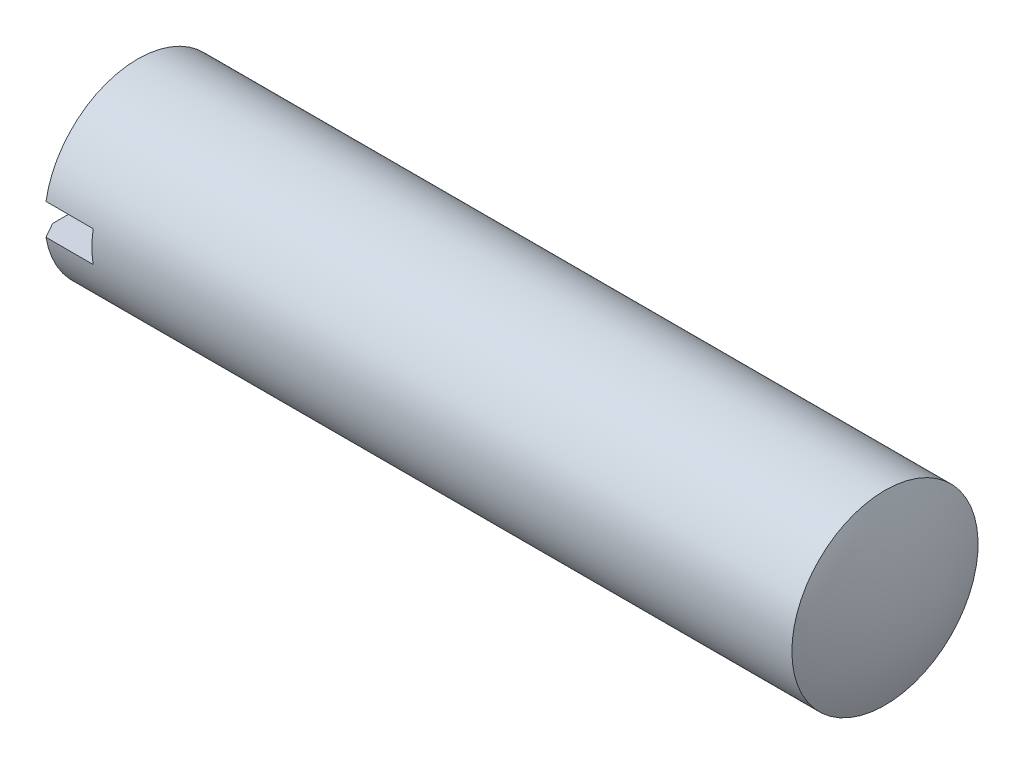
from build123d import *

# Parameters (mm, degrees)
SKETCH2_W  = 12
SKETCH2_H  = 2
SLOT_DEPTH = 3.6


with BuildPart() as part:
    # BodySke → BaseBody (revolve)
    with BuildSketch(Plane.XY, mode=Mode.PRIVATE) as basebody_sk:
        with BuildLine():
            Line((0.556565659, 6), (48.711457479, 6))
            ThreePointArc((48.711457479, 6), (49.674233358, 3.068401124), (50, 0))
            Line((50, 0), (0, 0))
            Line((0, 0), (0, 5.036))
            Line((0, 5.036), (0.556565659, 6))
        make_face()
    revolve(basebody_sk.sketch.rotate(Axis((-12.7, 0, 0), (1, 0, 0)), 90), axis=Axis((-12.7, 0, 0), (1, 0, 0)))

    # Sketch2 → Slot (cut)
    with BuildSketch(Plane(origin=(0, 0, 0), x_dir=(0, 0, -1), z_dir=(1, 0, 0))):
        Rectangle(SKETCH2_W, SKETCH2_H)
    extrude(amount=SLOT_DEPTH, mode=Mode.SUBTRACT)


solid = part.part
